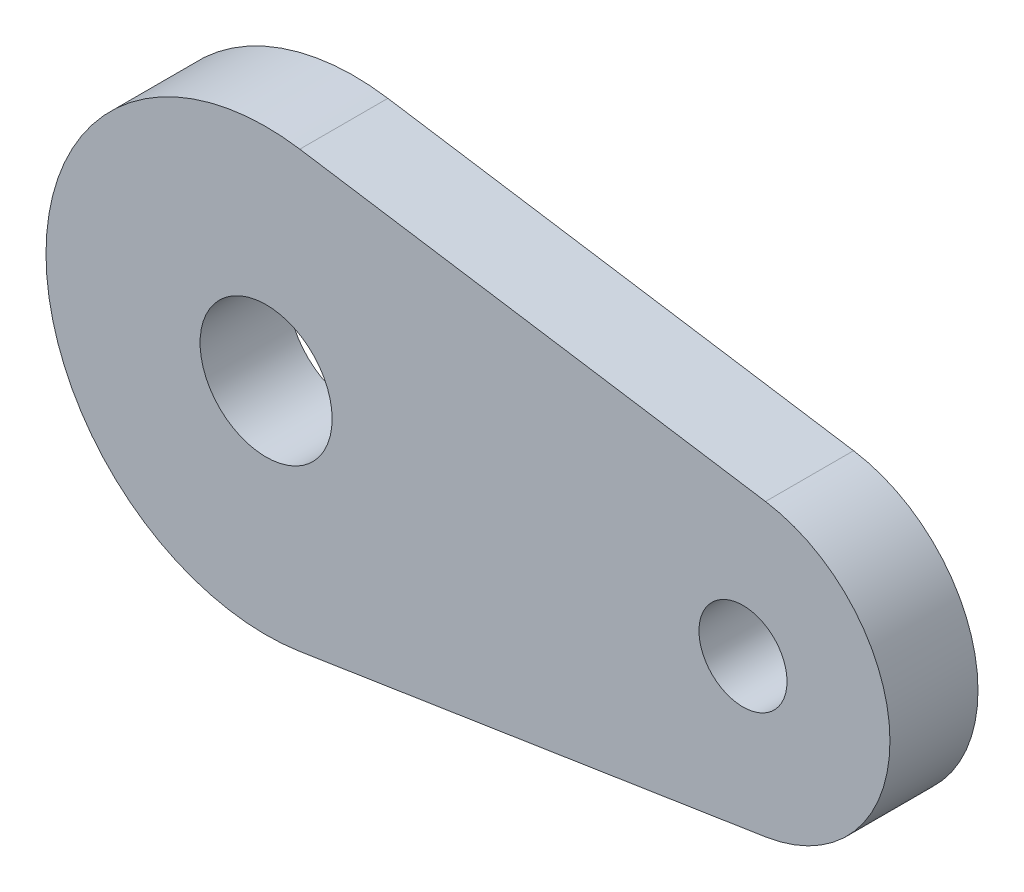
ISO-10303-21;
HEADER;
FILE_DESCRIPTION(('STEP AP214'),'2;1');
FILE_NAME('part.step','',(''),(''),'','','');
FILE_SCHEMA(('AUTOMOTIVE_DESIGN { 1 0 10303 214 1 1 1 1 }'));
ENDSEC;
DATA;
#1=APPLICATION_CONTEXT('core data for automotive mechanical design processes');
#2=APPLICATION_PROTOCOL_DEFINITION('international standard','automotive_design',2000,#1);
#3=PRODUCT_CONTEXT('',#1,'mechanical');
#4=PRODUCT('Part','Part','',(#3));
#5=PRODUCT_RELATED_PRODUCT_CATEGORY('part','',(#4));
#6=PRODUCT_DEFINITION_FORMATION('','',#4);
#7=PRODUCT_DEFINITION_CONTEXT('part definition',#1,'design');
#8=PRODUCT_DEFINITION('design','',#6,#7);
#9=PRODUCT_DEFINITION_SHAPE('','',#8);
#10=(LENGTH_UNIT() NAMED_UNIT(*) SI_UNIT(.MILLI.,.METRE.));
#11=(NAMED_UNIT(*) PLANE_ANGLE_UNIT() SI_UNIT($,.RADIAN.));
#12=(NAMED_UNIT(*) SI_UNIT($,.STERADIAN.) SOLID_ANGLE_UNIT());
#13=UNCERTAINTY_MEASURE_WITH_UNIT(LENGTH_MEASURE(1.E-05),#10,'distance_accuracy_value','');
#14=(GEOMETRIC_REPRESENTATION_CONTEXT(3) GLOBAL_UNCERTAINTY_ASSIGNED_CONTEXT((#13)) GLOBAL_UNIT_ASSIGNED_CONTEXT((#10,
#11,#12)) REPRESENTATION_CONTEXT('',''));
#15=CARTESIAN_POINT('',(0.,0.,0.));
#16=DIRECTION('',(0.,0.,1.));
#17=DIRECTION('',(1.,0.,0.));
#18=AXIS2_PLACEMENT_3D('',#15,#16,#17);
#19=CARTESIAN_POINT('',(4.60104946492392,-29.6450685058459,12.));
#20=DIRECTION('',(-0.153368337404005,0.988169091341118,0.));
#21=DIRECTION('',(-0.988169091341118,-0.153368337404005,0.));
#22=AXIS2_PLACEMENT_3D('',#19,#20,#21);
#23=PLANE('',#22);
#24=DIRECTION('',(0.988169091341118,0.153368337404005,0.));
#25=VECTOR('',#24,1.);
#26=CARTESIAN_POINT('',(4.60104946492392,-29.6450685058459,0.));
#27=LINE('',#26,#25);
#28=CARTESIAN_POINT('',(4.59627208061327,-29.6458099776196,0.));
#29=VERTEX_POINT('',#28);
#30=CARTESIAN_POINT('',(68.0721294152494,-19.794068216,0.));
#31=VERTEX_POINT('',#30);
#32=EDGE_CURVE('E107',#29,#31,#27,.T.);
#33=ORIENTED_EDGE('',*,*,#32,.T.);
#34=DIRECTION('',(0.,0.,-1.));
#35=VECTOR('',#34,1.);
#36=CARTESIAN_POINT('',(68.0721294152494,-19.794068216,12.));
#37=LINE('',#36,#35);
#38=CARTESIAN_POINT('',(68.0721294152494,-19.794068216,12.));
#39=VERTEX_POINT('',#38);
#40=EDGE_CURVE('E11',#39,#31,#37,.T.);
#41=ORIENTED_EDGE('',*,*,#40,.F.);
#42=DIRECTION('',(0.988169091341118,0.153368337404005,0.));
#43=VECTOR('',#42,1.);
#44=CARTESIAN_POINT('',(4.60104946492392,-29.6450685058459,12.));
#45=LINE('',#44,#43);
#46=CARTESIAN_POINT('',(4.59627208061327,-29.6458099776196,12.));
#47=VERTEX_POINT('',#46);
#48=EDGE_CURVE('E86',#47,#39,#45,.T.);
#49=ORIENTED_EDGE('',*,*,#48,.F.);
#50=DIRECTION('',(0.,0.,-1.));
#51=VECTOR('',#50,1.);
#52=CARTESIAN_POINT('',(4.59627208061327,-29.6458099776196,12.));
#53=LINE('',#52,#51);
#54=EDGE_CURVE('E97',#47,#29,#53,.T.);
#55=ORIENTED_EDGE('',*,*,#54,.T.);
#56=EDGE_LOOP('',(#33,#41,#49,#55));
#57=FACE_BOUND('',#56,.T.);
#58=ADVANCED_FACE('F38',(#57),#23,.F.);
#59=CARTESIAN_POINT('',(65.,0.,12.));
#60=DIRECTION('',(0.,0.,-1.));
#61=DIRECTION('',(-1.,0.,0.));
#62=AXIS2_PLACEMENT_3D('',#59,#60,#61);
#63=CYLINDRICAL_SURFACE('',#62,20.0310537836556);
#64=CARTESIAN_POINT('',(65.,0.,0.));
#65=DIRECTION('',(0.,0.,1.));
#66=DIRECTION('',(1.,0.,0.));
#67=AXIS2_PLACEMENT_3D('',#64,#65,#66);
#68=CIRCLE('',#67,20.0310537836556);
#69=CARTESIAN_POINT('',(68.0721294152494,19.794068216,0.));
#70=VERTEX_POINT('',#69);
#71=EDGE_CURVE('E91',#31,#70,#68,.T.);
#72=ORIENTED_EDGE('',*,*,#71,.T.);
#73=DIRECTION('',(0.,0.,-1.));
#74=VECTOR('',#73,1.);
#75=CARTESIAN_POINT('',(68.0721294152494,19.794068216,12.));
#76=LINE('',#75,#74);
#77=CARTESIAN_POINT('',(68.0721294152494,19.794068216,12.));
#78=VERTEX_POINT('',#77);
#79=EDGE_CURVE('E47',#78,#70,#76,.T.);
#80=ORIENTED_EDGE('',*,*,#79,.F.);
#81=CARTESIAN_POINT('',(65.,0.,12.));
#82=DIRECTION('',(0.,0.,1.));
#83=DIRECTION('',(1.,0.,0.));
#84=AXIS2_PLACEMENT_3D('',#81,#82,#83);
#85=CIRCLE('',#84,20.0310537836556);
#86=EDGE_CURVE('E81',#39,#78,#85,.T.);
#87=ORIENTED_EDGE('',*,*,#86,.F.);
#88=ORIENTED_EDGE('',*,*,#40,.T.);
#89=EDGE_LOOP('',(#72,#80,#87,#88));
#90=FACE_BOUND('',#89,.T.);
#91=ADVANCED_FACE('F90',(#90),#63,.T.);
#92=CARTESIAN_POINT('',(4.60104946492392,29.6450685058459,12.));
#93=DIRECTION('',(0.153368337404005,0.988169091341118,0.));
#94=DIRECTION('',(-0.988169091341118,0.153368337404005,0.));
#95=AXIS2_PLACEMENT_3D('',#92,#93,#94);
#96=PLANE('',#95);
#97=DIRECTION('',(0.988169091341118,-0.153368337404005,0.));
#98=VECTOR('',#97,1.);
#99=CARTESIAN_POINT('',(4.60104946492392,29.6450685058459,0.));
#100=LINE('',#99,#98);
#101=CARTESIAN_POINT('',(4.59627208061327,29.6458099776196,0.));
#102=VERTEX_POINT('',#101);
#103=EDGE_CURVE('E111',#102,#70,#100,.T.);
#104=ORIENTED_EDGE('',*,*,#103,.F.);
#105=DIRECTION('',(0.,0.,-1.));
#106=VECTOR('',#105,1.);
#107=CARTESIAN_POINT('',(4.59627208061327,29.6458099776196,12.));
#108=LINE('',#107,#106);
#109=CARTESIAN_POINT('',(4.59627208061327,29.6458099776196,12.));
#110=VERTEX_POINT('',#109);
#111=EDGE_CURVE('E71',#110,#102,#108,.T.);
#112=ORIENTED_EDGE('',*,*,#111,.F.);
#113=DIRECTION('',(0.988169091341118,-0.153368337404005,0.));
#114=VECTOR('',#113,1.);
#115=CARTESIAN_POINT('',(4.60104946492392,29.6450685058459,12.));
#116=LINE('',#115,#114);
#117=EDGE_CURVE('E84',#110,#78,#116,.T.);
#118=ORIENTED_EDGE('',*,*,#117,.T.);
#119=ORIENTED_EDGE('',*,*,#79,.T.);
#120=EDGE_LOOP('',(#104,#112,#118,#119));
#121=FACE_BOUND('',#120,.T.);
#122=ADVANCED_FACE('F95',(#121),#96,.T.);
#123=CARTESIAN_POINT('',(0.,0.,12.));
#124=DIRECTION('',(0.,0.,-1.));
#125=DIRECTION('',(-1.,0.,0.));
#126=AXIS2_PLACEMENT_3D('',#123,#124,#125);
#127=CYLINDRICAL_SURFACE('',#126,9.);
#128=CARTESIAN_POINT('',(0.,0.,12.));
#129=DIRECTION('',(0.,0.,1.));
#130=DIRECTION('',(1.,0.,0.));
#131=AXIS2_PLACEMENT_3D('',#128,#129,#130);
#132=CIRCLE('',#131,9.);
#133=CARTESIAN_POINT('',(9.,0.,12.));
#134=VERTEX_POINT('',#133);
#135=EDGE_CURVE('E149',#134,#134,#132,.T.);
#136=ORIENTED_EDGE('',*,*,#135,.T.);
#137=EDGE_LOOP('',(#136));
#138=FACE_BOUND('',#137,.T.);
#139=CARTESIAN_POINT('',(0.,0.,0.));
#140=DIRECTION('',(0.,0.,1.));
#141=DIRECTION('',(1.,0.,0.));
#142=AXIS2_PLACEMENT_3D('',#139,#140,#141);
#143=CIRCLE('',#142,9.);
#144=CARTESIAN_POINT('',(9.,0.,0.));
#145=VERTEX_POINT('',#144);
#146=EDGE_CURVE('E104',#145,#145,#143,.T.);
#147=ORIENTED_EDGE('',*,*,#146,.F.);
#148=EDGE_LOOP('',(#147));
#149=FACE_BOUND('',#148,.T.);
#150=ADVANCED_FACE('F138',(#138,#149),#127,.F.);
#151=CARTESIAN_POINT('',(65.,0.,12.));
#152=DIRECTION('',(0.,0.,-1.));
#153=DIRECTION('',(-1.,0.,0.));
#154=AXIS2_PLACEMENT_3D('',#151,#152,#153);
#155=CYLINDRICAL_SURFACE('',#154,6.);
#156=CARTESIAN_POINT('',(65.,0.,12.));
#157=DIRECTION('',(0.,0.,1.));
#158=DIRECTION('',(1.,0.,0.));
#159=AXIS2_PLACEMENT_3D('',#156,#157,#158);
#160=CIRCLE('',#159,6.);
#161=CARTESIAN_POINT('',(71.,0.,12.));
#162=VERTEX_POINT('',#161);
#163=EDGE_CURVE('E114',#162,#162,#160,.T.);
#164=ORIENTED_EDGE('',*,*,#163,.T.);
#165=EDGE_LOOP('',(#164));
#166=FACE_BOUND('',#165,.T.);
#167=CARTESIAN_POINT('',(65.,0.,0.));
#168=DIRECTION('',(0.,0.,1.));
#169=DIRECTION('',(1.,0.,0.));
#170=AXIS2_PLACEMENT_3D('',#167,#168,#169);
#171=CIRCLE('',#170,6.);
#172=CARTESIAN_POINT('',(71.,0.,0.));
#173=VERTEX_POINT('',#172);
#174=EDGE_CURVE('E101',#173,#173,#171,.T.);
#175=ORIENTED_EDGE('',*,*,#174,.F.);
#176=EDGE_LOOP('',(#175));
#177=FACE_BOUND('',#176,.T.);
#178=ADVANCED_FACE('F40',(#166,#177),#155,.F.);
#179=CARTESIAN_POINT('',(0.,0.,12.));
#180=DIRECTION('',(0.,0.,-1.));
#181=DIRECTION('',(-1.,0.,0.));
#182=AXIS2_PLACEMENT_3D('',#179,#180,#181);
#183=CYLINDRICAL_SURFACE('',#182,29.999996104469);
#184=CARTESIAN_POINT('',(0.,0.,0.));
#185=DIRECTION('',(0.,0.,1.));
#186=DIRECTION('',(1.,0.,0.));
#187=AXIS2_PLACEMENT_3D('',#184,#185,#186);
#188=CIRCLE('',#187,29.999996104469);
#189=EDGE_CURVE('E74',#102,#29,#188,.T.);
#190=ORIENTED_EDGE('',*,*,#189,.T.);
#191=ORIENTED_EDGE('',*,*,#54,.F.);
#192=CARTESIAN_POINT('',(0.,0.,12.));
#193=DIRECTION('',(0.,0.,1.));
#194=DIRECTION('',(1.,0.,0.));
#195=AXIS2_PLACEMENT_3D('',#192,#193,#194);
#196=CIRCLE('',#195,29.999996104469);
#197=EDGE_CURVE('E55',#110,#47,#196,.T.);
#198=ORIENTED_EDGE('',*,*,#197,.F.);
#199=ORIENTED_EDGE('',*,*,#111,.T.);
#200=EDGE_LOOP('',(#190,#191,#198,#199));
#201=FACE_BOUND('',#200,.T.);
#202=ADVANCED_FACE('F126',(#201),#183,.T.);
#203=CARTESIAN_POINT('',(0.,0.,12.));
#204=DIRECTION('',(0.,0.,1.));
#205=DIRECTION('',(1.,0.,0.));
#206=AXIS2_PLACEMENT_3D('',#203,#204,#205);
#207=PLANE('',#206);
#208=ORIENTED_EDGE('',*,*,#163,.F.);
#209=EDGE_LOOP('',(#208));
#210=FACE_BOUND('',#209,.T.);
#211=ORIENTED_EDGE('',*,*,#135,.F.);
#212=EDGE_LOOP('',(#211));
#213=FACE_BOUND('',#212,.T.);
#214=ORIENTED_EDGE('',*,*,#48,.T.);
#215=ORIENTED_EDGE('',*,*,#86,.T.);
#216=ORIENTED_EDGE('',*,*,#117,.F.);
#217=ORIENTED_EDGE('',*,*,#197,.T.);
#218=EDGE_LOOP('',(#214,#215,#216,#217));
#219=FACE_BOUND('',#218,.T.);
#220=ADVANCED_FACE('F82',(#210,#213,#219),#207,.T.);
#221=CARTESIAN_POINT('',(0.,0.,0.));
#222=DIRECTION('',(0.,0.,1.));
#223=DIRECTION('',(1.,0.,0.));
#224=AXIS2_PLACEMENT_3D('',#221,#222,#223);
#225=PLANE('',#224);
#226=ORIENTED_EDGE('',*,*,#174,.T.);
#227=EDGE_LOOP('',(#226));
#228=FACE_BOUND('',#227,.T.);
#229=ORIENTED_EDGE('',*,*,#146,.T.);
#230=EDGE_LOOP('',(#229));
#231=FACE_BOUND('',#230,.T.);
#232=ORIENTED_EDGE('',*,*,#32,.F.);
#233=ORIENTED_EDGE('',*,*,#189,.F.);
#234=ORIENTED_EDGE('',*,*,#103,.T.);
#235=ORIENTED_EDGE('',*,*,#71,.F.);
#236=EDGE_LOOP('',(#232,#233,#234,#235));
#237=FACE_BOUND('',#236,.T.);
#238=ADVANCED_FACE('F119',(#228,#231,#237),#225,.F.);
#239=CLOSED_SHELL('',(#58,#91,#122,#150,#178,#202,#220,#238));
#240=MANIFOLD_SOLID_BREP('B2',#239);
#241=ADVANCED_BREP_SHAPE_REPRESENTATION('',(#18,#240),#14);
#242=SHAPE_DEFINITION_REPRESENTATION(#9,#241);
ENDSEC;
END-ISO-10303-21;
